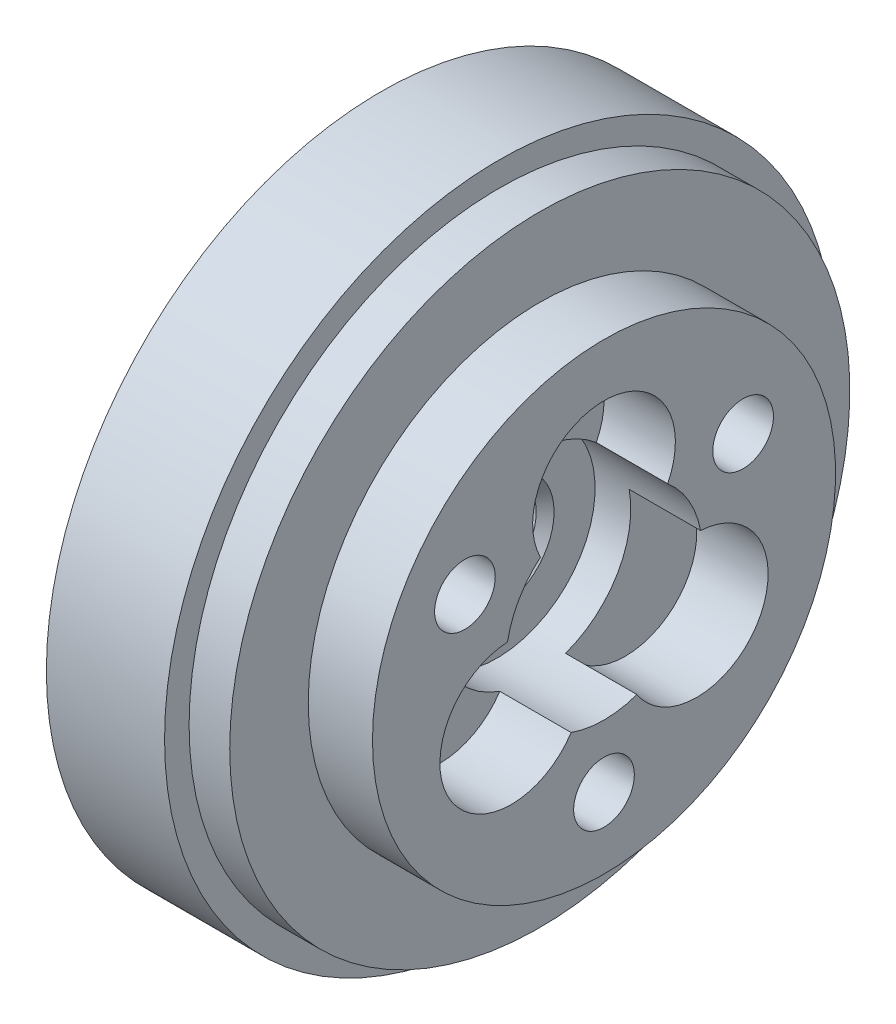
from build123d import *

# Parameters (mm, degrees)
CHANFREIN1_SIZE         = 0.2
CHANFREIN2_SIZE         = 1
ESQUISSE3_R             = 8
ENL_V_MAT_EXTRU_1_DEPTH = 8
TROU_TARAUD_M81_D       = 6.8
TROU_TARAUD_M81_DEPTH   = 13.75
TROU_TARAUD_M81_TIP     = 2.042926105


with BuildPart() as part:
    # Esquisse1 → R_volution1 (revolve)
    with BuildSketch(Plane.XY, mode=Mode.PRIVATE) as r_volution1_sk:
        Polygon((0, 0), (0, 37.5), (13.245994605, 37.5), (13.245994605, 34.75), (17.8, 34.75), (17.8, 25.95), (25, 25.95), (25, 0), align=None)
    revolve(r_volution1_sk.sketch.rotate(Axis((0, 0, 0), (1, 0, 0)), 90), axis=Axis((0, 0, 0), (1, 0, 0)))

    # Esquisse2 → Enl_vement de mati_re-R_volution1 (revolve, cut)
    with BuildSketch(Plane.XY, mode=Mode.PRIVATE) as enl_vement_de_mati_re_r_volution1_sk:
        Polygon((0, 2.01), (6, 2.01), (6, 5.4), (13, 5.4), (13, 11), (25, 11), (25, 0), (0, 0), align=None)
    revolve(enl_vement_de_mati_re_r_volution1_sk.sketch.rotate(Axis((0, 0, 0), (1, 0, 0)), 90), axis=Axis((0, 0, 0), (1, 0, 0)), mode=Mode.SUBTRACT)

    # Chanfrein1
    chanfrein1_edges = [part.edges().sort_by_distance(p)[0] for p in [
        (0, 0, -2.01),
        (6, 0, -2.01),
    ]]
    chamfer(chanfrein1_edges, length=CHANFREIN1_SIZE)

    # Chanfrein2
    chanfrein2_edges = [part.edges().sort_by_distance(p)[0] for p in [
        (13, 0, -5.4),
    ]]
    chamfer(chanfrein2_edges, length=CHANFREIN2_SIZE)

    # Esquisse3 → Enl_v. mat.-Extru.1 (cut)
    with BuildSketch(Plane(origin=(25, 0, 0), x_dir=(0, 0, -1), z_dir=(1, 0, 0))):
        with Locations((0, 12)):
            Circle(ESQUISSE3_R)
        with Locations((10.392304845, -6)):
            Circle(ESQUISSE3_R)
        with Locations((-10.392304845, -6)):
            Circle(ESQUISSE3_R)
    extrude(amount=-ENL_V_MAT_EXTRU_1_DEPTH, mode=Mode.SUBTRACT)

    # Trou taraud_ M81
    with Locations(Plane(origin=(25, 9, 15.588457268), x_dir=(0, 0, 1), z_dir=(1, 0, 0))):
        with Locations((0, 0), (-31.176914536, 0), (-15.588457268, 27)):
            Hole(TROU_TARAUD_M81_D / 2, depth=TROU_TARAUD_M81_DEPTH)
            with Locations((0, 0, -(TROU_TARAUD_M81_DEPTH + TROU_TARAUD_M81_TIP / 2))):  # 118° drill point
                Cone(0, TROU_TARAUD_M81_D / 2, TROU_TARAUD_M81_TIP, mode=Mode.SUBTRACT)


solid = part.part
